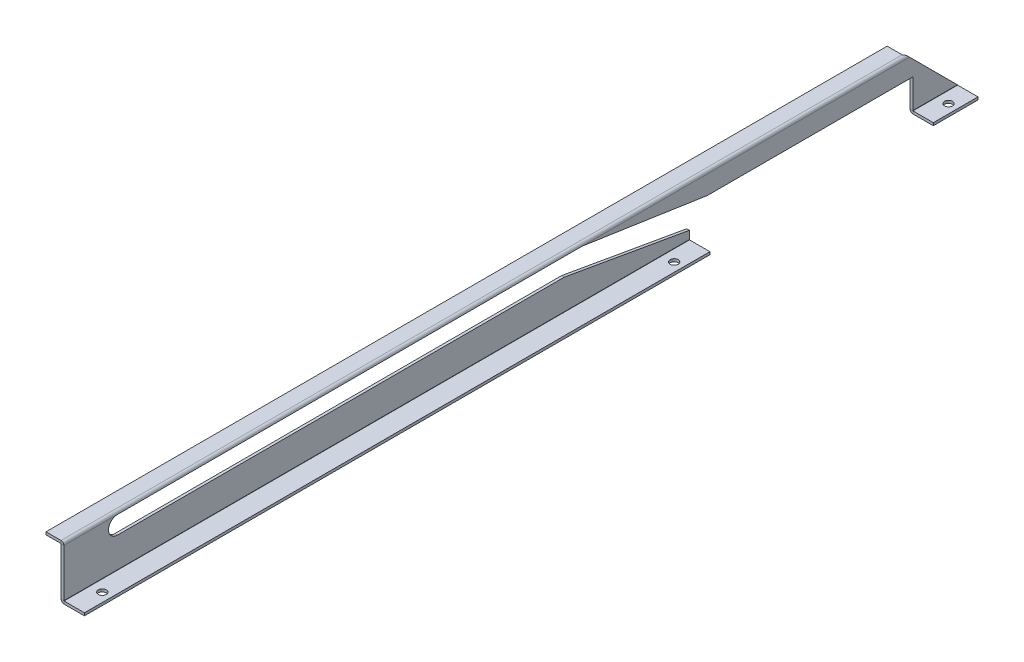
ISO-10303-21;
HEADER;
FILE_DESCRIPTION(('STEP AP214'),'2;1');
FILE_NAME('part.step','',(''),(''),'','','');
FILE_SCHEMA(('AUTOMOTIVE_DESIGN { 1 0 10303 214 1 1 1 1 }'));
ENDSEC;
DATA;
#1=APPLICATION_CONTEXT('core data for automotive mechanical design processes');
#2=APPLICATION_PROTOCOL_DEFINITION('international standard','automotive_design',2000,#1);
#3=PRODUCT_CONTEXT('',#1,'mechanical');
#4=PRODUCT('Part','Part','',(#3));
#5=PRODUCT_RELATED_PRODUCT_CATEGORY('part','',(#4));
#6=PRODUCT_DEFINITION_FORMATION('','',#4);
#7=PRODUCT_DEFINITION_CONTEXT('part definition',#1,'design');
#8=PRODUCT_DEFINITION('design','',#6,#7);
#9=PRODUCT_DEFINITION_SHAPE('','',#8);
#10=(LENGTH_UNIT() NAMED_UNIT(*) SI_UNIT(.MILLI.,.METRE.));
#11=(NAMED_UNIT(*) PLANE_ANGLE_UNIT() SI_UNIT($,.RADIAN.));
#12=(NAMED_UNIT(*) SI_UNIT($,.STERADIAN.) SOLID_ANGLE_UNIT());
#13=UNCERTAINTY_MEASURE_WITH_UNIT(LENGTH_MEASURE(1.E-05),#10,'distance_accuracy_value','');
#14=(GEOMETRIC_REPRESENTATION_CONTEXT(3) GLOBAL_UNCERTAINTY_ASSIGNED_CONTEXT((#13)) GLOBAL_UNIT_ASSIGNED_CONTEXT((#10,
#11,#12)) REPRESENTATION_CONTEXT('',''));
#15=CARTESIAN_POINT('',(0.,0.,0.));
#16=DIRECTION('',(0.,0.,1.));
#17=DIRECTION('',(1.,0.,0.));
#18=AXIS2_PLACEMENT_3D('',#15,#16,#17);
#19=CARTESIAN_POINT('',(-1.50000000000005,28.4999999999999,-500.));
#20=DIRECTION('',(-1.,0.,0.));
#21=DIRECTION('',(0.,-1.,0.));
#22=AXIS2_PLACEMENT_3D('',#19,#20,#21);
#23=PLANE('',#22);
#24=DIRECTION('',(0.,-1.,0.));
#25=VECTOR('',#24,1.);
#26=CARTESIAN_POINT('',(-1.50000000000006,-2.41327412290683,-475.));
#27=LINE('',#26,#25);
#28=CARTESIAN_POINT('',(-1.50000000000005,16.4132741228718,-475.));
#29=VERTEX_POINT('',#28);
#30=CARTESIAN_POINT('',(-1.49999999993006,0.100000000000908,-475.));
#31=VERTEX_POINT('',#30);
#32=EDGE_CURVE('E408',#29,#31,#27,.T.);
#33=ORIENTED_EDGE('',*,*,#32,.F.);
#34=DIRECTION('',(0.,0.,-1.));
#35=VECTOR('',#34,1.);
#36=CARTESIAN_POINT('',(-1.50000000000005,16.4132741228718,-475.));
#37=LINE('',#36,#35);
#38=CARTESIAN_POINT('',(-1.50000000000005,16.4132741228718,-360.));
#39=VERTEX_POINT('',#38);
#40=EDGE_CURVE('E405',#39,#29,#37,.T.);
#41=ORIENTED_EDGE('',*,*,#40,.F.);
#42=DIRECTION('',(0.,-0.148157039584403,-0.988963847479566));
#43=VECTOR('',#42,1.);
#44=CARTESIAN_POINT('',(-1.50000000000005,16.4132741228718,-360.));
#45=LINE('',#44,#43);
#46=CARTESIAN_POINT('',(-1.50000000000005,26.8999999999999,-290.));
#47=VERTEX_POINT('',#46);
#48=EDGE_CURVE('E399',#47,#39,#45,.T.);
#49=ORIENTED_EDGE('',*,*,#48,.F.);
#50=DIRECTION('',(0.,0.,1.));
#51=VECTOR('',#50,1.);
#52=CARTESIAN_POINT('',(-1.50000000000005,26.8999999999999,-500.));
#53=LINE('',#52,#51);
#54=CARTESIAN_POINT('',(-1.49999998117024,26.8999999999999,-473.2));
#55=VERTEX_POINT('',#54);
#56=EDGE_CURVE('E56',#55,#47,#53,.T.);
#57=ORIENTED_EDGE('',*,*,#56,.F.);
#58=DIRECTION('',(0.,0.707106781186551,0.707106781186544));
#59=VECTOR('',#58,1.);
#60=CARTESIAN_POINT('',(-1.50000000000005,14.3000000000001,-485.8));
#61=LINE('',#60,#59);
#62=CARTESIAN_POINT('',(-1.50000000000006,0.100000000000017,-500.));
#63=VERTEX_POINT('',#62);
#64=EDGE_CURVE('E420',#63,#55,#61,.T.);
#65=ORIENTED_EDGE('',*,*,#64,.F.);
#66=DIRECTION('',(0.,0.,1.));
#67=VECTOR('',#66,1.);
#68=CARTESIAN_POINT('',(-1.50000000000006,0.100000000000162,-500.));
#69=LINE('',#68,#67);
#70=EDGE_CURVE('E72',#63,#31,#69,.T.);
#71=ORIENTED_EDGE('',*,*,#70,.T.);
#72=EDGE_LOOP('',(#33,#41,#49,#57,#65,#71));
#73=FACE_BOUND('',#72,.T.);
#74=ADVANCED_FACE('F48',(#73),#23,.T.);
#75=CARTESIAN_POINT('',(0.,28.4999999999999,-500.));
#76=DIRECTION('',(-1.,0.,0.));
#77=DIRECTION('',(0.,-1.,0.));
#78=AXIS2_PLACEMENT_3D('',#75,#76,#77);
#79=PLANE('',#78);
#80=DIRECTION('',(0.,0.,-1.));
#81=VECTOR('',#80,1.);
#82=CARTESIAN_POINT('',(0.,16.4132741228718,-500.));
#83=LINE('',#82,#81);
#84=CARTESIAN_POINT('',(0.,16.4132741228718,-360.));
#85=VERTEX_POINT('',#84);
#86=CARTESIAN_POINT('',(0.,16.4132741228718,-475.));
#87=VERTEX_POINT('',#86);
#88=EDGE_CURVE('E458',#85,#87,#83,.T.);
#89=ORIENTED_EDGE('',*,*,#88,.T.);
#90=DIRECTION('',(0.,-1.,0.));
#91=VECTOR('',#90,1.);
#92=CARTESIAN_POINT('',(0.,28.4999999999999,-475.));
#93=LINE('',#92,#91);
#94=CARTESIAN_POINT('',(3.49435243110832E-11,0.100000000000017,-475.));
#95=VERTEX_POINT('',#94);
#96=EDGE_CURVE('E414',#87,#95,#93,.T.);
#97=ORIENTED_EDGE('',*,*,#96,.T.);
#98=DIRECTION('',(0.,0.,1.));
#99=VECTOR('',#98,1.);
#100=CARTESIAN_POINT('',(0.,0.0999999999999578,-500.));
#101=LINE('',#100,#99);
#102=CARTESIAN_POINT('',(3.49435243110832E-11,0.100000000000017,-500.));
#103=VERTEX_POINT('',#102);
#104=EDGE_CURVE('E466',#103,#95,#101,.T.);
#105=ORIENTED_EDGE('',*,*,#104,.F.);
#106=DIRECTION('',(0.,-0.707106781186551,-0.707106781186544));
#107=VECTOR('',#106,1.);
#108=CARTESIAN_POINT('',(0.,0.100000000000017,-500.));
#109=LINE('',#108,#107);
#110=CARTESIAN_POINT('',(1.88297595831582E-08,26.8999999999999,-473.2));
#111=VERTEX_POINT('',#110);
#112=EDGE_CURVE('E417',#111,#103,#109,.T.);
#113=ORIENTED_EDGE('',*,*,#112,.F.);
#114=DIRECTION('',(0.,0.,1.));
#115=VECTOR('',#114,1.);
#116=CARTESIAN_POINT('',(0.,26.8999999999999,-500.));
#117=LINE('',#116,#115);
#118=CARTESIAN_POINT('',(1.88297597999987E-08,26.8999999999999,-290.));
#119=VERTEX_POINT('',#118);
#120=EDGE_CURVE('E478',#111,#119,#117,.T.);
#121=ORIENTED_EDGE('',*,*,#120,.T.);
#122=DIRECTION('',(0.,-0.148157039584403,-0.988963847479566));
#123=VECTOR('',#122,1.);
#124=CARTESIAN_POINT('',(0.,-3.83448992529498,-495.155958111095));
#125=LINE('',#124,#123);
#126=EDGE_CURVE('E411',#119,#85,#125,.T.);
#127=ORIENTED_EDGE('',*,*,#126,.T.);
#128=EDGE_LOOP('',(#89,#97,#105,#113,#121,#127));
#129=FACE_BOUND('',#128,.T.);
#130=ADVANCED_FACE('F444',(#129),#79,.F.);
#131=CARTESIAN_POINT('',(-1.50005000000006,0.100000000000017,-500.));
#132=DIRECTION('',(0.,-0.707106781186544,0.707106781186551));
#133=DIRECTION('',(0.,-0.707106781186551,-0.707106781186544));
#134=AXIS2_PLACEMENT_3D('',#131,#132,#133);
#135=PLANE('',#134);
#136=CARTESIAN_POINT('',(1.88297595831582E-08,26.8999999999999,-473.2));
#137=CARTESIAN_POINT('',(-1.49999998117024,26.8999999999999,-473.2));
#138=B_SPLINE_CURVE_WITH_KNOTS('',1,(#136,#137),.UNSPECIFIED.,.F.,.F.,(2,2),(0.,1.),.UNSPECIFIED.);
#139=EDGE_CURVE('E427',#55,#111,#138,.F.);
#140=ORIENTED_EDGE('',*,*,#139,.T.);
#141=ORIENTED_EDGE('',*,*,#112,.T.);
#142=DIRECTION('',(-1.,1.36031232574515E-13,0.));
#143=VECTOR('',#142,1.);
#144=CARTESIAN_POINT('',(0.,0.0999999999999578,-500.));
#145=LINE('',#144,#143);
#146=EDGE_CURVE('E475',#103,#63,#145,.T.);
#147=ORIENTED_EDGE('',*,*,#146,.T.);
#148=ORIENTED_EDGE('',*,*,#64,.T.);
#149=EDGE_LOOP('',(#140,#141,#147,#148));
#150=FACE_BOUND('',#149,.T.);
#151=ADVANCED_FACE('F433',(#150),#135,.F.);
#152=CARTESIAN_POINT('',(-1.50000000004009,-2.41327412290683,-475.));
#153=DIRECTION('',(0.,0.,-1.));
#154=DIRECTION('',(1.35830067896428E-13,1.,0.));
#155=AXIS2_PLACEMENT_3D('',#152,#153,#154);
#156=PLANE('',#155);
#157=DIRECTION('',(-1.,5.94142790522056E-13,0.));
#158=VECTOR('',#157,1.);
#159=CARTESIAN_POINT('',(0.,0.100000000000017,-475.));
#160=LINE('',#159,#158);
#161=EDGE_CURVE('E469',#95,#31,#160,.T.);
#162=ORIENTED_EDGE('',*,*,#161,.F.);
#163=ORIENTED_EDGE('',*,*,#96,.F.);
#164=DIRECTION('',(-1.,0.,0.));
#165=VECTOR('',#164,1.);
#166=CARTESIAN_POINT('',(0.00377501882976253,16.4132741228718,-475.));
#167=LINE('',#166,#165);
#168=EDGE_CURVE('E409',#87,#29,#167,.T.);
#169=ORIENTED_EDGE('',*,*,#168,.T.);
#170=ORIENTED_EDGE('',*,*,#32,.T.);
#171=EDGE_LOOP('',(#162,#163,#169,#170));
#172=FACE_BOUND('',#171,.T.);
#173=ADVANCED_FACE('F443',(#172),#156,.F.);
#174=CARTESIAN_POINT('',(0.00377501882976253,16.4132741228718,-475.));
#175=DIRECTION('',(0.,1.,0.));
#176=DIRECTION('',(-1.,0.,0.));
#177=AXIS2_PLACEMENT_3D('',#174,#175,#176);
#178=PLANE('',#177);
#179=DIRECTION('',(-1.,0.,0.));
#180=VECTOR('',#179,1.);
#181=CARTESIAN_POINT('',(0.00377501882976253,16.4132741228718,-360.));
#182=LINE('',#181,#180);
#183=EDGE_CURVE('E412',#85,#39,#182,.T.);
#184=ORIENTED_EDGE('',*,*,#183,.T.);
#185=ORIENTED_EDGE('',*,*,#40,.T.);
#186=ORIENTED_EDGE('',*,*,#168,.F.);
#187=ORIENTED_EDGE('',*,*,#88,.F.);
#188=EDGE_LOOP('',(#184,#185,#186,#187));
#189=FACE_BOUND('',#188,.T.);
#190=ADVANCED_FACE('F448',(#189),#178,.F.);
#191=CARTESIAN_POINT('',(0.00377501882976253,16.4132741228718,-360.));
#192=DIRECTION('',(0.,0.988963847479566,-0.148157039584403));
#193=DIRECTION('',(0.,0.148157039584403,0.988963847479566));
#194=AXIS2_PLACEMENT_3D('',#191,#192,#193);
#195=PLANE('',#194);
#196=DIRECTION('',(-1.,0.,0.));
#197=VECTOR('',#196,1.);
#198=CARTESIAN_POINT('',(0.0037750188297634,26.8999999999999,-290.));
#199=LINE('',#198,#197);
#200=EDGE_CURVE('E12',#119,#47,#199,.T.);
#201=ORIENTED_EDGE('',*,*,#200,.T.);
#202=ORIENTED_EDGE('',*,*,#48,.T.);
#203=ORIENTED_EDGE('',*,*,#183,.F.);
#204=ORIENTED_EDGE('',*,*,#126,.F.);
#205=EDGE_LOOP('',(#201,#202,#203,#204));
#206=FACE_BOUND('',#205,.T.);
#207=ADVANCED_FACE('F445',(#206),#195,.F.);
#208=CARTESIAN_POINT('',(0.0999999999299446,0.0999999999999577,-475.));
#209=DIRECTION('',(0.,0.,-1.));
#210=DIRECTION('',(-1.,0.,0.));
#211=AXIS2_PLACEMENT_3D('',#208,#209,#210);
#212=PLANE('',#211);
#213=ORIENTED_EDGE('',*,*,#161,.T.);
#214=CARTESIAN_POINT('',(0.0999999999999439,0.0999999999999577,-475.));
#215=DIRECTION('',(0.,0.,-1.));
#216=DIRECTION('',(-1.,0.,0.));
#217=AXIS2_PLACEMENT_3D('',#214,#215,#216);
#218=CIRCLE('',#217,1.59999999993);
#219=CARTESIAN_POINT('',(0.0999999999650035,-1.50000000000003,-475.));
#220=VERTEX_POINT('',#219);
#221=EDGE_CURVE('E350',#31,#220,#218,.F.);
#222=ORIENTED_EDGE('',*,*,#221,.T.);
#223=DIRECTION('',(-1.35830067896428E-13,1.,0.));
#224=VECTOR('',#223,1.);
#225=CARTESIAN_POINT('',(0.0999999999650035,-1.50000000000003,-475.));
#226=LINE('',#225,#224);
#227=CARTESIAN_POINT('',(0.0999999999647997,-3.49825842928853E-11,-475.));
#228=VERTEX_POINT('',#227);
#229=EDGE_CURVE('E385',#220,#228,#226,.T.);
#230=ORIENTED_EDGE('',*,*,#229,.T.);
#231=CARTESIAN_POINT('',(0.0999999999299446,0.0999999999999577,-475.));
#232=DIRECTION('',(0.,0.,1.));
#233=DIRECTION('',(-1.,0.,0.));
#234=AXIS2_PLACEMENT_3D('',#231,#232,#233);
#235=CIRCLE('',#234,0.0999999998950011);
#236=EDGE_CURVE('E400',#95,#228,#235,.T.);
#237=ORIENTED_EDGE('',*,*,#236,.F.);
#238=EDGE_LOOP('',(#213,#222,#230,#237));
#239=FACE_BOUND('',#238,.T.);
#240=ADVANCED_FACE('F502',(#239),#212,.F.);
#241=CARTESIAN_POINT('',(0.0999999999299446,0.0999999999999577,-500.));
#242=DIRECTION('',(0.,0.,1.));
#243=DIRECTION('',(1.,0.,0.));
#244=AXIS2_PLACEMENT_3D('',#241,#242,#243);
#245=PLANE('',#244);
#246=DIRECTION('',(0.,1.,0.));
#247=VECTOR('',#246,1.);
#248=CARTESIAN_POINT('',(0.0999999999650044,-1.50000000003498,-500.));
#249=LINE('',#248,#247);
#250=CARTESIAN_POINT('',(0.0999999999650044,-1.50000000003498,-500.));
#251=VERTEX_POINT('',#250);
#252=CARTESIAN_POINT('',(0.100000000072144,6.99570474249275E-11,-500.));
#253=VERTEX_POINT('',#252);
#254=EDGE_CURVE('E353',#251,#253,#249,.T.);
#255=ORIENTED_EDGE('',*,*,#254,.F.);
#256=CARTESIAN_POINT('',(0.0999999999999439,0.0999999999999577,-500.));
#257=DIRECTION('',(0.,0.,-1.));
#258=DIRECTION('',(-1.,0.,0.));
#259=AXIS2_PLACEMENT_3D('',#256,#257,#258);
#260=CIRCLE('',#259,1.59999999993);
#261=EDGE_CURVE('E401',#251,#63,#260,.T.);
#262=ORIENTED_EDGE('',*,*,#261,.T.);
#263=ORIENTED_EDGE('',*,*,#146,.F.);
#264=CARTESIAN_POINT('',(0.0999999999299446,0.0999999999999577,-500.));
#265=DIRECTION('',(0.,0.,-1.));
#266=DIRECTION('',(-1.,0.,0.));
#267=AXIS2_PLACEMENT_3D('',#264,#265,#266);
#268=CIRCLE('',#267,0.0999999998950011);
#269=EDGE_CURVE('E396',#253,#103,#268,.T.);
#270=ORIENTED_EDGE('',*,*,#269,.F.);
#271=EDGE_LOOP('',(#255,#262,#263,#270));
#272=FACE_BOUND('',#271,.T.);
#273=ADVANCED_FACE('F511',(#272),#245,.F.);
#274=CARTESIAN_POINT('',(0.0999999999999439,0.0999999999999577,-462.329252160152));
#275=DIRECTION('',(0.,0.,-1.));
#276=DIRECTION('',(-1.,0.,0.));
#277=AXIS2_PLACEMENT_3D('',#274,#275,#276);
#278=CYLINDRICAL_SURFACE('',#277,0.0999999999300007);
#279=ORIENTED_EDGE('',*,*,#269,.T.);
#280=ORIENTED_EDGE('',*,*,#104,.T.);
#281=ORIENTED_EDGE('',*,*,#236,.T.);
#282=DIRECTION('',(0.,0.,1.));
#283=VECTOR('',#282,1.);
#284=CARTESIAN_POINT('',(0.0999999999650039,-3.49826197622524E-11,-500.));
#285=LINE('',#284,#283);
#286=EDGE_CURVE('E374',#253,#228,#285,.T.);
#287=ORIENTED_EDGE('',*,*,#286,.F.);
#288=EDGE_LOOP('',(#279,#280,#281,#287));
#289=FACE_BOUND('',#288,.T.);
#290=ADVANCED_FACE('F523',(#289),#278,.F.);
#291=CARTESIAN_POINT('',(0.0999999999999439,0.0999999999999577,-462.329252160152));
#292=DIRECTION('',(0.,0.,-1.));
#293=DIRECTION('',(-1.,0.,0.));
#294=AXIS2_PLACEMENT_3D('',#291,#292,#293);
#295=CYLINDRICAL_SURFACE('',#294,1.59999999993);
#296=ORIENTED_EDGE('',*,*,#261,.F.);
#297=DIRECTION('',(0.,0.,1.));
#298=VECTOR('',#297,1.);
#299=CARTESIAN_POINT('',(0.0999999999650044,-1.50000000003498,-500.));
#300=LINE('',#299,#298);
#301=EDGE_CURVE('E388',#251,#220,#300,.T.);
#302=ORIENTED_EDGE('',*,*,#301,.T.);
#303=ORIENTED_EDGE('',*,*,#221,.F.);
#304=ORIENTED_EDGE('',*,*,#70,.F.);
#305=EDGE_LOOP('',(#296,#302,#303,#304));
#306=FACE_BOUND('',#305,.T.);
#307=ADVANCED_FACE('F503',(#306),#295,.T.);
#308=CARTESIAN_POINT('',(11.499999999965,-3.49826197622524E-11,-500.));
#309=DIRECTION('',(-1.,0.,0.));
#310=DIRECTION('',(0.,0.,1.));
#311=AXIS2_PLACEMENT_3D('',#308,#309,#310);
#312=PLANE('',#311);
#313=DIRECTION('',(0.,0.,1.));
#314=VECTOR('',#313,1.);
#315=CARTESIAN_POINT('',(11.499999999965,-3.49826197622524E-11,-500.));
#316=LINE('',#315,#314);
#317=CARTESIAN_POINT('',(11.499999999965,-3.49826197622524E-11,-500.));
#318=VERTEX_POINT('',#317);
#319=CARTESIAN_POINT('',(11.499999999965,-3.49826197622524E-11,-475.));
#320=VERTEX_POINT('',#319);
#321=EDGE_CURVE('E382',#318,#320,#316,.T.);
#322=ORIENTED_EDGE('',*,*,#321,.T.);
#323=DIRECTION('',(0.,1.,0.));
#324=VECTOR('',#323,1.);
#325=CARTESIAN_POINT('',(11.499999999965,-1.50000000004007,-475.));
#326=LINE('',#325,#324);
#327=CARTESIAN_POINT('',(11.499999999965,-1.50000000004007,-475.));
#328=VERTEX_POINT('',#327);
#329=EDGE_CURVE('E370',#328,#320,#326,.T.);
#330=ORIENTED_EDGE('',*,*,#329,.F.);
#331=DIRECTION('',(0.,0.,1.));
#332=VECTOR('',#331,1.);
#333=CARTESIAN_POINT('',(11.499999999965,-1.50000000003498,-500.));
#334=LINE('',#333,#332);
#335=CARTESIAN_POINT('',(11.499999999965,-1.50000000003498,-500.));
#336=VERTEX_POINT('',#335);
#337=EDGE_CURVE('E355',#336,#328,#334,.T.);
#338=ORIENTED_EDGE('',*,*,#337,.F.);
#339=DIRECTION('',(0.,-1.,0.));
#340=VECTOR('',#339,1.);
#341=CARTESIAN_POINT('',(11.499999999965,-3.49826197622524E-11,-500.));
#342=LINE('',#341,#340);
#343=EDGE_CURVE('E348',#318,#336,#342,.T.);
#344=ORIENTED_EDGE('',*,*,#343,.F.);
#345=EDGE_LOOP('',(#322,#330,#338,#344));
#346=FACE_BOUND('',#345,.T.);
#347=ADVANCED_FACE('F637',(#346),#312,.F.);
#348=CARTESIAN_POINT('',(6.49999999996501,-1.50000000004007,-488.5));
#349=DIRECTION('',(0.,1.,0.));
#350=DIRECTION('',(0.,0.,1.));
#351=AXIS2_PLACEMENT_3D('',#348,#349,#350);
#352=CYLINDRICAL_SURFACE('',#351,2.25);
#353=CARTESIAN_POINT('',(6.49999999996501,-1.50000000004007,-488.5));
#354=DIRECTION('',(0.,1.,0.));
#355=DIRECTION('',(0.,0.,1.));
#356=AXIS2_PLACEMENT_3D('',#353,#354,#355);
#357=CIRCLE('',#356,2.25);
#358=CARTESIAN_POINT('',(6.49999999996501,-1.50000000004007,-486.25));
#359=VERTEX_POINT('',#358);
#360=EDGE_CURVE('E363',#359,#359,#357,.T.);
#361=ORIENTED_EDGE('',*,*,#360,.F.);
#362=EDGE_LOOP('',(#361));
#363=FACE_BOUND('',#362,.T.);
#364=CARTESIAN_POINT('',(6.49999999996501,-3.49826197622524E-11,-488.5));
#365=DIRECTION('',(0.,1.,0.));
#366=DIRECTION('',(0.,0.,1.));
#367=AXIS2_PLACEMENT_3D('',#364,#365,#366);
#368=CIRCLE('',#367,2.25);
#369=CARTESIAN_POINT('',(6.49999999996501,-3.49826197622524E-11,-486.25));
#370=VERTEX_POINT('',#369);
#371=EDGE_CURVE('E377',#370,#370,#368,.T.);
#372=ORIENTED_EDGE('',*,*,#371,.T.);
#373=EDGE_LOOP('',(#372));
#374=FACE_BOUND('',#373,.T.);
#375=ADVANCED_FACE('F640',(#363,#374),#352,.F.);
#376=CARTESIAN_POINT('',(-3.49958777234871E-11,-3.49826197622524E-11,-500.));
#377=DIRECTION('',(0.,-1.,0.));
#378=DIRECTION('',(0.,0.,-1.));
#379=AXIS2_PLACEMENT_3D('',#376,#377,#378);
#380=PLANE('',#379);
#381=ORIENTED_EDGE('',*,*,#371,.F.);
#382=EDGE_LOOP('',(#381));
#383=FACE_BOUND('',#382,.T.);
#384=ORIENTED_EDGE('',*,*,#286,.T.);
#385=DIRECTION('',(-1.,0.,0.));
#386=VECTOR('',#385,1.);
#387=CARTESIAN_POINT('',(0.0999999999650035,-3.49826197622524E-11,-475.));
#388=LINE('',#387,#386);
#389=EDGE_CURVE('E368',#320,#228,#388,.T.);
#390=ORIENTED_EDGE('',*,*,#389,.F.);
#391=ORIENTED_EDGE('',*,*,#321,.F.);
#392=DIRECTION('',(1.,0.,0.));
#393=VECTOR('',#392,1.);
#394=CARTESIAN_POINT('',(-3.49958777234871E-11,-3.49826197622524E-11,-500.));
#395=LINE('',#394,#393);
#396=EDGE_CURVE('E351',#253,#318,#395,.T.);
#397=ORIENTED_EDGE('',*,*,#396,.F.);
#398=EDGE_LOOP('',(#384,#390,#391,#397));
#399=FACE_BOUND('',#398,.T.);
#400=ADVANCED_FACE('F519',(#383,#399),#380,.F.);
#401=CARTESIAN_POINT('',(0.0999999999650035,-1.50000000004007,-475.));
#402=DIRECTION('',(0.,0.,-1.));
#403=DIRECTION('',(-1.,0.,0.));
#404=AXIS2_PLACEMENT_3D('',#401,#402,#403);
#405=PLANE('',#404);
#406=ORIENTED_EDGE('',*,*,#229,.F.);
#407=DIRECTION('',(-1.,0.,0.));
#408=VECTOR('',#407,1.);
#409=CARTESIAN_POINT('',(0.0999999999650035,-1.50000000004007,-475.));
#410=LINE('',#409,#408);
#411=EDGE_CURVE('E361',#328,#220,#410,.T.);
#412=ORIENTED_EDGE('',*,*,#411,.F.);
#413=ORIENTED_EDGE('',*,*,#329,.T.);
#414=ORIENTED_EDGE('',*,*,#389,.T.);
#415=EDGE_LOOP('',(#406,#412,#413,#414));
#416=FACE_BOUND('',#415,.T.);
#417=ADVANCED_FACE('F647',(#416),#405,.F.);
#418=CARTESIAN_POINT('',(-3.49958777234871E-11,-1.50000000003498,-500.));
#419=DIRECTION('',(0.,-1.,0.));
#420=DIRECTION('',(0.,0.,-1.));
#421=AXIS2_PLACEMENT_3D('',#418,#419,#420);
#422=PLANE('',#421);
#423=ORIENTED_EDGE('',*,*,#360,.T.);
#424=EDGE_LOOP('',(#423));
#425=FACE_BOUND('',#424,.T.);
#426=ORIENTED_EDGE('',*,*,#411,.T.);
#427=ORIENTED_EDGE('',*,*,#301,.F.);
#428=DIRECTION('',(1.,0.,0.));
#429=VECTOR('',#428,1.);
#430=CARTESIAN_POINT('',(-3.49958777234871E-11,-1.50000000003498,-500.));
#431=LINE('',#430,#429);
#432=EDGE_CURVE('E358',#251,#336,#431,.T.);
#433=ORIENTED_EDGE('',*,*,#432,.T.);
#434=ORIENTED_EDGE('',*,*,#337,.T.);
#435=EDGE_LOOP('',(#426,#427,#433,#434));
#436=FACE_BOUND('',#435,.T.);
#437=ADVANCED_FACE('F507',(#425,#436),#422,.T.);
#438=CARTESIAN_POINT('',(0.0999999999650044,0.0999999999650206,-500.));
#439=DIRECTION('',(0.,0.,-1.));
#440=DIRECTION('',(-1.,0.,0.));
#441=AXIS2_PLACEMENT_3D('',#438,#439,#440);
#442=PLANE('',#441);
#443=ORIENTED_EDGE('',*,*,#432,.F.);
#444=ORIENTED_EDGE('',*,*,#254,.T.);
#445=ORIENTED_EDGE('',*,*,#396,.T.);
#446=ORIENTED_EDGE('',*,*,#343,.T.);
#447=EDGE_LOOP('',(#443,#444,#445,#446));
#448=FACE_BOUND('',#447,.T.);
#449=ADVANCED_FACE('F515',(#448),#442,.T.);
#450=CARTESIAN_POINT('',(1.88297597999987E-08,26.8999999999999,-236.599999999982));
#451=DIRECTION('',(0.,-1.,0.));
#452=DIRECTION('',(0.,0.,-1.));
#453=AXIS2_PLACEMENT_3D('',#450,#451,#452);
#454=PLANE('',#453);
#455=ORIENTED_EDGE('',*,*,#200,.F.);
#456=DIRECTION('',(0.,0.,-1.));
#457=VECTOR('',#456,1.);
#458=CARTESIAN_POINT('',(1.88297597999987E-08,26.8999999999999,-473.2));
#459=LINE('',#458,#457);
#460=CARTESIAN_POINT('',(0.,26.8999999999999,-30.));
#461=VERTEX_POINT('',#460);
#462=EDGE_CURVE('E1095',#461,#119,#459,.T.);
#463=ORIENTED_EDGE('',*,*,#462,.F.);
#464=DIRECTION('',(-1.,0.,0.));
#465=VECTOR('',#464,1.);
#466=CARTESIAN_POINT('',(0.0037750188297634,26.8999999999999,-30.));
#467=LINE('',#466,#465);
#468=CARTESIAN_POINT('',(-1.49999998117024,26.8999999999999,-30.));
#469=VERTEX_POINT('',#468);
#470=EDGE_CURVE('E224',#461,#469,#467,.T.);
#471=ORIENTED_EDGE('',*,*,#470,.T.);
#472=DIRECTION('',(0.,0.,1.));
#473=VECTOR('',#472,1.);
#474=CARTESIAN_POINT('',(-1.49999998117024,26.8999999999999,-236.599999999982));
#475=LINE('',#474,#473);
#476=EDGE_CURVE('E64',#469,#47,#475,.F.);
#477=ORIENTED_EDGE('',*,*,#476,.T.);
#478=EDGE_LOOP('',(#455,#463,#471,#477));
#479=FACE_BOUND('',#478,.T.);
#480=ADVANCED_FACE('F574',(#479),#454,.T.);
#481=CARTESIAN_POINT('',(-9.99999994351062,26.9999999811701,-499.99999999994));
#482=DIRECTION('',(1.,0.,0.));
#483=DIRECTION('',(0.,0.,-1.));
#484=AXIS2_PLACEMENT_3D('',#481,#482,#483);
#485=PLANE('',#484);
#486=DIRECTION('',(0.,0.,1.));
#487=VECTOR('',#486,1.);
#488=CARTESIAN_POINT('',(-9.99999994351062,28.4999999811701,-499.99999999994));
#489=LINE('',#488,#487);
#490=CARTESIAN_POINT('',(-9.99999994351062,28.4999999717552,-470.686725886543));
#491=VERTEX_POINT('',#490);
#492=CARTESIAN_POINT('',(-9.99999994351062,28.4999999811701,6.02295990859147E-11));
#493=VERTEX_POINT('',#492);
#494=EDGE_CURVE('E1110',#491,#493,#489,.T.);
#495=ORIENTED_EDGE('',*,*,#494,.F.);
#496=DIRECTION('',(0.,1.,0.));
#497=VECTOR('',#496,1.);
#498=CARTESIAN_POINT('',(-9.99999994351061,26.9999499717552,-470.686725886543));
#499=LINE('',#498,#497);
#500=CARTESIAN_POINT('',(-9.99999994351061,26.9999999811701,-470.686725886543));
#501=VERTEX_POINT('',#500);
#502=EDGE_CURVE('E1118',#501,#491,#499,.T.);
#503=ORIENTED_EDGE('',*,*,#502,.F.);
#504=DIRECTION('',(0.,0.,1.));
#505=VECTOR('',#504,1.);
#506=CARTESIAN_POINT('',(-9.99999994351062,26.9999999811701,-499.99999999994));
#507=LINE('',#506,#505);
#508=CARTESIAN_POINT('',(-9.99999994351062,26.9999999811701,6.02295990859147E-11));
#509=VERTEX_POINT('',#508);
#510=EDGE_CURVE('E1105',#501,#509,#507,.T.);
#511=ORIENTED_EDGE('',*,*,#510,.T.);
#512=DIRECTION('',(0.,1.,0.));
#513=VECTOR('',#512,1.);
#514=CARTESIAN_POINT('',(-9.99999994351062,26.9999999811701,6.02295990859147E-11));
#515=LINE('',#514,#513);
#516=EDGE_CURVE('E1107',#509,#493,#515,.T.);
#517=ORIENTED_EDGE('',*,*,#516,.T.);
#518=EDGE_LOOP('',(#495,#503,#511,#517));
#519=FACE_BOUND('',#518,.T.);
#520=ADVANCED_FACE('F717',(#519),#485,.F.);
#521=CARTESIAN_POINT('',(-9.99999994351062,28.4999999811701,-499.99999999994));
#522=DIRECTION('',(0.,-1.,0.));
#523=DIRECTION('',(0.,0.,-1.));
#524=AXIS2_PLACEMENT_3D('',#521,#522,#523);
#525=PLANE('',#524);
#526=DIRECTION('',(0.,0.,1.));
#527=VECTOR('',#526,1.);
#528=CARTESIAN_POINT('',(-1.59999994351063,28.4999999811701,-499.99999999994));
#529=LINE('',#528,#527);
#530=CARTESIAN_POINT('',(-1.59999996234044,28.5000000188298,-470.686725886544));
#531=VERTEX_POINT('',#530);
#532=CARTESIAN_POINT('',(-1.59999996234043,28.5000000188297,6.01740879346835E-11));
#533=VERTEX_POINT('',#532);
#534=EDGE_CURVE('E1098',#531,#533,#529,.T.);
#535=ORIENTED_EDGE('',*,*,#534,.F.);
#536=DIRECTION('',(1.,0.,0.));
#537=VECTOR('',#536,1.);
#538=CARTESIAN_POINT('',(-1.59999993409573,28.4999999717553,-470.686725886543));
#539=LINE('',#538,#537);
#540=EDGE_CURVE('E1120',#491,#531,#539,.T.);
#541=ORIENTED_EDGE('',*,*,#540,.F.);
#542=ORIENTED_EDGE('',*,*,#494,.T.);
#543=DIRECTION('',(1.,0.,0.));
#544=VECTOR('',#543,1.);
#545=CARTESIAN_POINT('',(-9.99999994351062,28.4999999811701,6.02295990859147E-11));
#546=LINE('',#545,#544);
#547=EDGE_CURVE('E1112',#493,#533,#546,.T.);
#548=ORIENTED_EDGE('',*,*,#547,.T.);
#549=EDGE_LOOP('',(#535,#541,#542,#548));
#550=FACE_BOUND('',#549,.T.);
#551=ADVANCED_FACE('F630',(#550),#525,.F.);
#552=CARTESIAN_POINT('',(-1.59999993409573,26.9999499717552,-470.686725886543));
#553=DIRECTION('',(0.,0.,1.));
#554=DIRECTION('',(1.,0.,0.));
#555=AXIS2_PLACEMENT_3D('',#552,#553,#554);
#556=PLANE('',#555);
#557=DIRECTION('',(-1.,0.,0.));
#558=VECTOR('',#557,1.);
#559=CARTESIAN_POINT('',(-9.99999994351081,26.9999999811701,-470.686725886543));
#560=LINE('',#559,#558);
#561=CARTESIAN_POINT('',(-1.59999994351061,26.9999999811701,-470.686725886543));
#562=VERTEX_POINT('',#561);
#563=EDGE_CURVE('E1114',#562,#501,#560,.T.);
#564=ORIENTED_EDGE('',*,*,#563,.T.);
#565=ORIENTED_EDGE('',*,*,#502,.T.);
#566=ORIENTED_EDGE('',*,*,#540,.T.);
#567=CARTESIAN_POINT('',(-1.59999999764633,27.0000000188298,-470.686725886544));
#568=CARTESIAN_POINT('',(-1.59999996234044,28.5000000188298,-470.686725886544));
#569=B_SPLINE_CURVE_WITH_KNOTS('',1,(#567,#568),.UNSPECIFIED.,.F.,.F.,(2,2),(0.,1.),.UNSPECIFIED.);
#570=EDGE_CURVE('E613',#562,#531,#569,.T.);
#571=ORIENTED_EDGE('',*,*,#570,.F.);
#572=EDGE_LOOP('',(#564,#565,#566,#571));
#573=FACE_BOUND('',#572,.T.);
#574=ADVANCED_FACE('F619',(#573),#556,.F.);
#575=CARTESIAN_POINT('',(-9.99999994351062,26.9999999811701,-499.99999999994));
#576=DIRECTION('',(0.,-1.,0.));
#577=DIRECTION('',(0.,0.,-1.));
#578=AXIS2_PLACEMENT_3D('',#575,#576,#577);
#579=PLANE('',#578);
#580=ORIENTED_EDGE('',*,*,#563,.F.);
#581=DIRECTION('',(0.,0.,1.));
#582=VECTOR('',#581,1.);
#583=CARTESIAN_POINT('',(-1.59999994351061,26.9999999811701,-499.99999999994));
#584=LINE('',#583,#582);
#585=CARTESIAN_POINT('',(-1.59999994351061,26.9999999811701,6.02295990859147E-11));
#586=VERTEX_POINT('',#585);
#587=EDGE_CURVE('E535',#562,#586,#584,.T.);
#588=ORIENTED_EDGE('',*,*,#587,.T.);
#589=DIRECTION('',(1.,0.,0.));
#590=VECTOR('',#589,1.);
#591=CARTESIAN_POINT('',(-9.99999994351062,26.9999999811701,6.02295990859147E-11));
#592=LINE('',#591,#590);
#593=EDGE_CURVE('E1126',#509,#586,#592,.T.);
#594=ORIENTED_EDGE('',*,*,#593,.F.);
#595=ORIENTED_EDGE('',*,*,#510,.F.);
#596=EDGE_LOOP('',(#580,#588,#594,#595));
#597=FACE_BOUND('',#596,.T.);
#598=ADVANCED_FACE('F629',(#597),#579,.T.);
#599=CARTESIAN_POINT('',(0.100000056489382,0.0999999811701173,6.02295990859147E-11));
#600=DIRECTION('',(0.,0.,-1.));
#601=DIRECTION('',(-1.,0.,0.));
#602=AXIS2_PLACEMENT_3D('',#599,#600,#601);
#603=PLANE('',#602);
#604=ORIENTED_EDGE('',*,*,#593,.T.);
#605=DIRECTION('',(0.,1.,0.));
#606=VECTOR('',#605,1.);
#607=CARTESIAN_POINT('',(-1.59999994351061,26.9999999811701,6.02295990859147E-11));
#608=LINE('',#607,#606);
#609=EDGE_CURVE('E393',#586,#533,#608,.T.);
#610=ORIENTED_EDGE('',*,*,#609,.T.);
#611=ORIENTED_EDGE('',*,*,#547,.F.);
#612=ORIENTED_EDGE('',*,*,#516,.F.);
#613=EDGE_LOOP('',(#604,#610,#611,#612));
#614=FACE_BOUND('',#613,.T.);
#615=ADVANCED_FACE('F573',(#614),#603,.F.);
#616=CARTESIAN_POINT('',(1.88297595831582E-08,26.8999999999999,-473.2));
#617=CARTESIAN_POINT('',(1.88297595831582E-08,27.1094583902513,-472.99054160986));
#618=CARTESIAN_POINT('',(-0.0416436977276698,27.318796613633,-472.781120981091));
#619=CARTESIAN_POINT('',(-0.201941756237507,27.7057903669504,-472.362241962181));
#620=CARTESIAN_POINT('',(-0.320533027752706,27.8832747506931,-472.152802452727));
#621=CARTESIAN_POINT('',(-0.616725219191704,28.1794669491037,-471.733923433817));
#622=CARTESIAN_POINT('',(-0.794209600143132,28.2980582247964,-471.524483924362));
#623=CARTESIAN_POINT('',(-1.18120334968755,28.458356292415,-471.105604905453));
#624=CARTESIAN_POINT('',(-1.39054157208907,28.5000000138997,-470.896184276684));
#625=CARTESIAN_POINT('',(-1.59999996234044,28.5000000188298,-470.686725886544));
#626=CARTESIAN_POINT('',(-1.49999998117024,26.8999999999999,-473.2));
#627=CARTESIAN_POINT('',(-1.49999998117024,26.9130899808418,-472.990560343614));
#628=CARTESIAN_POINT('',(-1.50260271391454,26.9261747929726,-472.781120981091));
#629=CARTESIAN_POINT('',(-1.51262134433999,26.9503619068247,-472.362241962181));
#630=CARTESIAN_POINT('',(-1.52003330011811,26.9614546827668,-472.152802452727));
#631=CARTESIAN_POINT('',(-1.53854531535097,26.9799666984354,-471.733923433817));
#632=CARTESIAN_POINT('',(-1.54963809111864,26.9873786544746,-471.524483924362));
#633=CARTESIAN_POINT('',(-1.5738252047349,26.9973972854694,-471.105604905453));
#634=CARTESIAN_POINT('',(-1.58691001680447,27.0000000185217,-470.89616554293));
#635=CARTESIAN_POINT('',(-1.59999999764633,27.0000000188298,-470.686725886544));
#636=B_SPLINE_SURFACE_WITH_KNOTS('',1,3,((#616,#617,#618,#619,#620,#621,#622,#623,#624,#625),
(#626,#627,#628,#629,#630,#631,#632,#633,#634,#635)),.UNSPECIFIED.,.F.,.F.,.F.,(2,2),(4,2,2,2,
4),(0.,1.),(0.,0.25,0.5,0.75,1.),.UNSPECIFIED.);
#637=CARTESIAN_POINT('',(-1.49999998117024,26.8999999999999,-473.2));
#638=CARTESIAN_POINT('',(-1.49999998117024,26.9130899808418,-472.990560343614));
#639=CARTESIAN_POINT('',(-1.50260271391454,26.9261747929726,-472.781120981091));
#640=CARTESIAN_POINT('',(-1.51262134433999,26.9503619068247,-472.362241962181));
#641=CARTESIAN_POINT('',(-1.52003330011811,26.9614546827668,-472.152802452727));
#642=CARTESIAN_POINT('',(-1.53854531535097,26.9799666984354,-471.733923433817));
#643=CARTESIAN_POINT('',(-1.54963809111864,26.9873786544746,-471.524483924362));
#644=CARTESIAN_POINT('',(-1.5738252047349,26.9973972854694,-471.105604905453));
#645=CARTESIAN_POINT('',(-1.58691001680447,27.0000000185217,-470.89616554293));
#646=CARTESIAN_POINT('',(-1.59999999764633,27.0000000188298,-470.686725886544));
#647=B_SPLINE_CURVE_WITH_KNOTS('',3,(#637,#638,#639,#640,#641,#642,#643,#644,#645,#646),
.UNSPECIFIED.,.F.,.F.,(4,2,2,2,4),(0.,0.25,0.5,0.75,1.),.UNSPECIFIED.);
#648=EDGE_CURVE('E532',#55,#562,#647,.T.);
#649=CARTESIAN_POINT('',(-1.59999996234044,28.5000000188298,-470.686725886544));
#650=CARTESIAN_POINT('',(-1.39054157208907,28.5000000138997,-470.896184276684));
#651=CARTESIAN_POINT('',(-1.18120334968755,28.458356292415,-471.105604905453));
#652=CARTESIAN_POINT('',(-0.794209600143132,28.2980582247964,-471.524483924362));
#653=CARTESIAN_POINT('',(-0.616725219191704,28.1794669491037,-471.733923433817));
#654=CARTESIAN_POINT('',(-0.320533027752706,27.8832747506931,-472.152802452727));
#655=CARTESIAN_POINT('',(-0.201941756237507,27.7057903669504,-472.362241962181));
#656=CARTESIAN_POINT('',(-0.0416436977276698,27.318796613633,-472.781120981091));
#657=CARTESIAN_POINT('',(1.88297595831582E-08,27.1094583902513,-472.99054160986));
#658=CARTESIAN_POINT('',(1.88297595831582E-08,26.8999999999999,-473.2));
#659=B_SPLINE_CURVE_WITH_KNOTS('',3,(#649,#650,#651,#652,#653,#654,#655,#656,#657,#658),
.UNSPECIFIED.,.F.,.F.,(4,2,2,2,4),(0.,0.25,0.5,0.75,1.),.UNSPECIFIED.);
#660=EDGE_CURVE('E1100',#111,#531,#659,.F.);
#661=ORIENTED_EDGE('',*,*,#139,.F.);
#662=ORIENTED_EDGE('',*,*,#648,.T.);
#663=ORIENTED_EDGE('',*,*,#570,.T.);
#664=ORIENTED_EDGE('',*,*,#660,.F.);
#665=EDGE_LOOP('',(#661,#662,#663,#664));
#666=FACE_BOUND('',#665,.T.);
#667=ADVANCED_FACE('F566',(#666),#636,.T.);
#668=CARTESIAN_POINT('',(-1.60000001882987,26.8999999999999,6.01740879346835E-11));
#669=DIRECTION('',(1.50812282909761E-11,0.,1.));
#670=DIRECTION('',(1.,0.,-1.50812282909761E-11));
#671=AXIS2_PLACEMENT_3D('',#668,#669,#670);
#672=PLANE('',#671);
#673=ORIENTED_EDGE('',*,*,#609,.F.);
#674=CARTESIAN_POINT('',(-1.60000001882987,26.8999999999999,6.01740879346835E-11));
#675=DIRECTION('',(-1.50812282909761E-11,0.,-1.));
#676=DIRECTION('',(-1.,0.,1.50812282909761E-11));
#677=AXIS2_PLACEMENT_3D('',#674,#675,#676);
#678=CIRCLE('',#677,0.100000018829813);
#679=CARTESIAN_POINT('',(-1.50000000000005,26.8999999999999,0.));
#680=VERTEX_POINT('',#679);
#681=EDGE_CURVE('E539',#586,#680,#678,.T.);
#682=ORIENTED_EDGE('',*,*,#681,.T.);
#683=DIRECTION('',(-1.,0.,0.));
#684=VECTOR('',#683,1.);
#685=CARTESIAN_POINT('',(0.,26.8999999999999,0.));
#686=LINE('',#685,#684);
#687=CARTESIAN_POINT('',(0.,26.8999999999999,2.18713935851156E-11));
#688=VERTEX_POINT('',#687);
#689=EDGE_CURVE('E1141',#688,#680,#686,.T.);
#690=ORIENTED_EDGE('',*,*,#689,.F.);
#691=CARTESIAN_POINT('',(-1.60000001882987,26.8999999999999,6.01740879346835E-11));
#692=DIRECTION('',(-1.50812282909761E-11,0.,-1.));
#693=DIRECTION('',(-1.,0.,1.50812282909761E-11));
#694=AXIS2_PLACEMENT_3D('',#691,#692,#693);
#695=CIRCLE('',#694,1.60000002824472);
#696=EDGE_CURVE('E336',#533,#688,#695,.T.);
#697=ORIENTED_EDGE('',*,*,#696,.F.);
#698=EDGE_LOOP('',(#673,#682,#690,#697));
#699=FACE_BOUND('',#698,.T.);
#700=ADVANCED_FACE('F563',(#699),#672,.T.);
#701=CARTESIAN_POINT('',(-1.60000000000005,26.8999999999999,-709.809051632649));
#702=DIRECTION('',(0.,0.,1.));
#703=DIRECTION('',(1.,0.,0.));
#704=AXIS2_PLACEMENT_3D('',#701,#702,#703);
#705=CYLINDRICAL_SURFACE('',#704,1.60000001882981);
#706=ORIENTED_EDGE('',*,*,#696,.T.);
#707=DIRECTION('',(0.,0.,1.));
#708=VECTOR('',#707,1.);
#709=CARTESIAN_POINT('',(0.,26.8999999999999,-500.));
#710=LINE('',#709,#708);
#711=EDGE_CURVE('E228',#461,#688,#710,.T.);
#712=ORIENTED_EDGE('',*,*,#711,.F.);
#713=ORIENTED_EDGE('',*,*,#462,.T.);
#714=ORIENTED_EDGE('',*,*,#120,.F.);
#715=ORIENTED_EDGE('',*,*,#660,.T.);
#716=ORIENTED_EDGE('',*,*,#534,.T.);
#717=EDGE_LOOP('',(#706,#712,#713,#714,#715,#716));
#718=FACE_BOUND('',#717,.T.);
#719=ADVANCED_FACE('F560',(#718),#705,.T.);
#720=CARTESIAN_POINT('',(-1.60000000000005,26.8999999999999,-709.809051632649));
#721=DIRECTION('',(0.,0.,1.));
#722=DIRECTION('',(1.,0.,0.));
#723=AXIS2_PLACEMENT_3D('',#720,#721,#722);
#724=CYLINDRICAL_SURFACE('',#723,0.100000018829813);
#725=ORIENTED_EDGE('',*,*,#681,.F.);
#726=ORIENTED_EDGE('',*,*,#587,.F.);
#727=ORIENTED_EDGE('',*,*,#648,.F.);
#728=ORIENTED_EDGE('',*,*,#56,.T.);
#729=ORIENTED_EDGE('',*,*,#476,.F.);
#730=DIRECTION('',(0.,0.,1.));
#731=VECTOR('',#730,1.);
#732=CARTESIAN_POINT('',(-1.50000000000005,26.8999999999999,-500.));
#733=LINE('',#732,#731);
#734=EDGE_CURVE('E331',#469,#680,#733,.T.);
#735=ORIENTED_EDGE('',*,*,#734,.T.);
#736=EDGE_LOOP('',(#725,#726,#727,#728,#729,#735));
#737=FACE_BOUND('',#736,.T.);
#738=ADVANCED_FACE('F528',(#737),#724,.F.);
#739=CARTESIAN_POINT('',(0.0999999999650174,-1.50000000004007,-350.));
#740=DIRECTION('',(0.,0.,1.));
#741=DIRECTION('',(1.,0.,0.));
#742=AXIS2_PLACEMENT_3D('',#739,#740,#741);
#743=PLANE('',#742);
#744=DIRECTION('',(1.35830067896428E-13,-1.,0.));
#745=VECTOR('',#744,1.);
#746=CARTESIAN_POINT('',(0.0999999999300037,-3.498258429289E-11,-350.));
#747=LINE('',#746,#745);
#748=CARTESIAN_POINT('',(0.0999999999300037,-3.498258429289E-11,-350.));
#749=VERTEX_POINT('',#748);
#750=CARTESIAN_POINT('',(0.0999999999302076,-1.50000000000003,-350.));
#751=VERTEX_POINT('',#750);
#752=EDGE_CURVE('E291',#749,#751,#747,.T.);
#753=ORIENTED_EDGE('',*,*,#752,.F.);
#754=DIRECTION('',(1.,0.,0.));
#755=VECTOR('',#754,1.);
#756=CARTESIAN_POINT('',(0.0999999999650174,-3.49826197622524E-11,-350.));
#757=LINE('',#756,#755);
#758=CARTESIAN_POINT('',(11.499999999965,-3.49826197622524E-11,-350.));
#759=VERTEX_POINT('',#758);
#760=EDGE_CURVE('E329',#749,#759,#757,.T.);
#761=ORIENTED_EDGE('',*,*,#760,.T.);
#762=DIRECTION('',(0.,1.,0.));
#763=VECTOR('',#762,1.);
#764=CARTESIAN_POINT('',(11.499999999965,-1.50000000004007,-350.));
#765=LINE('',#764,#763);
#766=CARTESIAN_POINT('',(11.499999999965,-1.50000000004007,-350.));
#767=VERTEX_POINT('',#766);
#768=EDGE_CURVE('E326',#767,#759,#765,.T.);
#769=ORIENTED_EDGE('',*,*,#768,.F.);
#770=DIRECTION('',(1.,0.,0.));
#771=VECTOR('',#770,1.);
#772=CARTESIAN_POINT('',(0.0999999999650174,-1.50000000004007,-350.));
#773=LINE('',#772,#771);
#774=EDGE_CURVE('E304',#751,#767,#773,.T.);
#775=ORIENTED_EDGE('',*,*,#774,.F.);
#776=EDGE_LOOP('',(#753,#761,#769,#775));
#777=FACE_BOUND('',#776,.T.);
#778=ADVANCED_FACE('F559',(#777),#743,.F.);
#779=CARTESIAN_POINT('',(11.499999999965,-3.49826197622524E-11,-500.));
#780=DIRECTION('',(-1.,0.,0.));
#781=DIRECTION('',(0.,0.,1.));
#782=AXIS2_PLACEMENT_3D('',#779,#780,#781);
#783=PLANE('',#782);
#784=DIRECTION('',(0.,0.,1.));
#785=VECTOR('',#784,1.);
#786=CARTESIAN_POINT('',(11.499999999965,-1.50000000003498,-500.));
#787=LINE('',#786,#785);
#788=CARTESIAN_POINT('',(11.499999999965,-1.50000000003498,0.));
#789=VERTEX_POINT('',#788);
#790=EDGE_CURVE('E302',#767,#789,#787,.T.);
#791=ORIENTED_EDGE('',*,*,#790,.F.);
#792=ORIENTED_EDGE('',*,*,#768,.T.);
#793=DIRECTION('',(0.,0.,1.));
#794=VECTOR('',#793,1.);
#795=CARTESIAN_POINT('',(11.499999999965,-3.49826197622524E-11,-500.));
#796=LINE('',#795,#794);
#797=CARTESIAN_POINT('',(11.499999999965,-3.49826197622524E-11,0.));
#798=VERTEX_POINT('',#797);
#799=EDGE_CURVE('E324',#759,#798,#796,.T.);
#800=ORIENTED_EDGE('',*,*,#799,.T.);
#801=DIRECTION('',(0.,-1.,0.));
#802=VECTOR('',#801,1.);
#803=CARTESIAN_POINT('',(11.499999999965,-3.49826197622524E-11,0.));
#804=LINE('',#803,#802);
#805=EDGE_CURVE('E321',#798,#789,#804,.T.);
#806=ORIENTED_EDGE('',*,*,#805,.T.);
#807=EDGE_LOOP('',(#791,#792,#800,#806));
#808=FACE_BOUND('',#807,.T.);
#809=ADVANCED_FACE('F765',(#808),#783,.F.);
#810=CARTESIAN_POINT('',(6.49999999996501,-1.50000000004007,-15.));
#811=DIRECTION('',(0.,1.,0.));
#812=DIRECTION('',(0.,0.,1.));
#813=AXIS2_PLACEMENT_3D('',#810,#811,#812);
#814=CYLINDRICAL_SURFACE('',#813,2.25);
#815=CARTESIAN_POINT('',(6.49999999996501,-1.50000000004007,-15.));
#816=DIRECTION('',(0.,1.,0.));
#817=DIRECTION('',(0.,0.,1.));
#818=AXIS2_PLACEMENT_3D('',#815,#816,#817);
#819=CIRCLE('',#818,2.25);
#820=CARTESIAN_POINT('',(6.49999999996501,-1.50000000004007,-12.75));
#821=VERTEX_POINT('',#820);
#822=EDGE_CURVE('E307',#821,#821,#819,.T.);
#823=ORIENTED_EDGE('',*,*,#822,.F.);
#824=EDGE_LOOP('',(#823));
#825=FACE_BOUND('',#824,.T.);
#826=CARTESIAN_POINT('',(6.49999999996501,-3.49826197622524E-11,-15.));
#827=DIRECTION('',(0.,1.,0.));
#828=DIRECTION('',(0.,0.,1.));
#829=AXIS2_PLACEMENT_3D('',#826,#827,#828);
#830=CIRCLE('',#829,2.25);
#831=CARTESIAN_POINT('',(6.49999999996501,-3.49826197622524E-11,-12.75));
#832=VERTEX_POINT('',#831);
#833=EDGE_CURVE('E318',#832,#832,#830,.T.);
#834=ORIENTED_EDGE('',*,*,#833,.T.);
#835=EDGE_LOOP('',(#834));
#836=FACE_BOUND('',#835,.T.);
#837=ADVANCED_FACE('F773',(#825,#836),#814,.F.);
#838=CARTESIAN_POINT('',(6.49999999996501,-1.50000000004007,-335.));
#839=DIRECTION('',(0.,1.,0.));
#840=DIRECTION('',(0.,0.,1.));
#841=AXIS2_PLACEMENT_3D('',#838,#839,#840);
#842=CYLINDRICAL_SURFACE('',#841,2.25);
#843=CARTESIAN_POINT('',(6.49999999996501,-1.50000000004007,-335.));
#844=DIRECTION('',(0.,1.,0.));
#845=DIRECTION('',(0.,0.,1.));
#846=AXIS2_PLACEMENT_3D('',#843,#844,#845);
#847=CIRCLE('',#846,2.25);
#848=CARTESIAN_POINT('',(6.49999999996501,-1.50000000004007,-332.75));
#849=VERTEX_POINT('',#848);
#850=EDGE_CURVE('E312',#849,#849,#847,.T.);
#851=ORIENTED_EDGE('',*,*,#850,.F.);
#852=EDGE_LOOP('',(#851));
#853=FACE_BOUND('',#852,.T.);
#854=CARTESIAN_POINT('',(6.49999999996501,-3.49826197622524E-11,-335.));
#855=DIRECTION('',(0.,1.,0.));
#856=DIRECTION('',(0.,0.,1.));
#857=AXIS2_PLACEMENT_3D('',#854,#855,#856);
#858=CIRCLE('',#857,2.25);
#859=CARTESIAN_POINT('',(6.49999999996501,-3.49826197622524E-11,-332.75));
#860=VERTEX_POINT('',#859);
#861=EDGE_CURVE('E315',#860,#860,#858,.T.);
#862=ORIENTED_EDGE('',*,*,#861,.T.);
#863=EDGE_LOOP('',(#862));
#864=FACE_BOUND('',#863,.T.);
#865=ADVANCED_FACE('F781',(#853,#864),#842,.F.);
#866=CARTESIAN_POINT('',(-3.49958777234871E-11,-1.50000000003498,-500.));
#867=DIRECTION('',(0.,-1.,0.));
#868=DIRECTION('',(0.,0.,-1.));
#869=AXIS2_PLACEMENT_3D('',#866,#867,#868);
#870=PLANE('',#869);
#871=ORIENTED_EDGE('',*,*,#850,.T.);
#872=EDGE_LOOP('',(#871));
#873=FACE_BOUND('',#872,.T.);
#874=ORIENTED_EDGE('',*,*,#822,.T.);
#875=EDGE_LOOP('',(#874));
#876=FACE_BOUND('',#875,.T.);
#877=ORIENTED_EDGE('',*,*,#774,.T.);
#878=ORIENTED_EDGE('',*,*,#790,.T.);
#879=DIRECTION('',(1.,0.,0.));
#880=VECTOR('',#879,1.);
#881=CARTESIAN_POINT('',(-3.49958777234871E-11,-1.50000000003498,0.));
#882=LINE('',#881,#880);
#883=CARTESIAN_POINT('',(0.0999999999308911,-1.50000000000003,0.));
#884=VERTEX_POINT('',#883);
#885=EDGE_CURVE('E294',#884,#789,#882,.T.);
#886=ORIENTED_EDGE('',*,*,#885,.F.);
#887=DIRECTION('',(0.,0.,1.));
#888=VECTOR('',#887,1.);
#889=CARTESIAN_POINT('',(0.0999999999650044,-1.50000000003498,-500.));
#890=LINE('',#889,#888);
#891=EDGE_CURVE('E272',#751,#884,#890,.T.);
#892=ORIENTED_EDGE('',*,*,#891,.F.);
#893=EDGE_LOOP('',(#877,#878,#886,#892));
#894=FACE_BOUND('',#893,.T.);
#895=ADVANCED_FACE('F789',(#873,#876,#894),#870,.T.);
#896=CARTESIAN_POINT('',(-1.500000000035,0.0999999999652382,0.));
#897=DIRECTION('',(0.,0.,1.));
#898=DIRECTION('',(1.,0.,0.));
#899=AXIS2_PLACEMENT_3D('',#896,#897,#898);
#900=PLANE('',#899);
#901=DIRECTION('',(1.,0.,0.));
#902=VECTOR('',#901,1.);
#903=CARTESIAN_POINT('',(-3.49958777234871E-11,-3.49826197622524E-11,0.));
#904=LINE('',#903,#902);
#905=CARTESIAN_POINT('',(0.100000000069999,1.04956692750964E-10,0.));
#906=VERTEX_POINT('',#905);
#907=EDGE_CURVE('E275',#906,#798,#904,.T.);
#908=ORIENTED_EDGE('',*,*,#907,.F.);
#909=DIRECTION('',(0.,-1.,0.));
#910=VECTOR('',#909,1.);
#911=CARTESIAN_POINT('',(0.0999999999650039,-3.49826197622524E-11,0.));
#912=LINE('',#911,#910);
#913=EDGE_CURVE('E299',#906,#884,#912,.T.);
#914=ORIENTED_EDGE('',*,*,#913,.T.);
#915=ORIENTED_EDGE('',*,*,#885,.T.);
#916=ORIENTED_EDGE('',*,*,#805,.F.);
#917=EDGE_LOOP('',(#908,#914,#915,#916));
#918=FACE_BOUND('',#917,.T.);
#919=ADVANCED_FACE('F797',(#918),#900,.T.);
#920=CARTESIAN_POINT('',(0.0999999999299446,0.0999999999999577,-350.));
#921=DIRECTION('',(0.,0.,1.));
#922=DIRECTION('',(1.,0.,0.));
#923=AXIS2_PLACEMENT_3D('',#920,#921,#922);
#924=PLANE('',#923);
#925=ORIENTED_EDGE('',*,*,#752,.T.);
#926=CARTESIAN_POINT('',(0.0999999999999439,0.0999999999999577,-350.));
#927=DIRECTION('',(0.,0.,-1.));
#928=DIRECTION('',(-1.,0.,0.));
#929=AXIS2_PLACEMENT_3D('',#926,#927,#928);
#930=CIRCLE('',#929,1.59999999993);
#931=CARTESIAN_POINT('',(-1.50000000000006,0.100000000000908,-350.));
#932=VERTEX_POINT('',#931);
#933=EDGE_CURVE('E288',#751,#932,#930,.T.);
#934=ORIENTED_EDGE('',*,*,#933,.T.);
#935=DIRECTION('',(1.,-5.94142790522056E-13,0.));
#936=VECTOR('',#935,1.);
#937=CARTESIAN_POINT('',(-1.50000000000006,0.100000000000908,-350.));
#938=LINE('',#937,#936);
#939=CARTESIAN_POINT('',(3.49435243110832E-11,0.100000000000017,-350.));
#940=VERTEX_POINT('',#939);
#941=EDGE_CURVE('E283',#932,#940,#938,.T.);
#942=ORIENTED_EDGE('',*,*,#941,.T.);
#943=CARTESIAN_POINT('',(0.0999999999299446,0.0999999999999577,-350.));
#944=DIRECTION('',(0.,0.,-1.));
#945=DIRECTION('',(1.,0.,0.));
#946=AXIS2_PLACEMENT_3D('',#943,#944,#945);
#947=CIRCLE('',#946,0.0999999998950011);
#948=EDGE_CURVE('E255',#749,#940,#947,.T.);
#949=ORIENTED_EDGE('',*,*,#948,.F.);
#950=EDGE_LOOP('',(#925,#934,#942,#949));
#951=FACE_BOUND('',#950,.T.);
#952=ADVANCED_FACE('F805',(#951),#924,.F.);
#953=CARTESIAN_POINT('',(-3.49958777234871E-11,-3.49826197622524E-11,-500.));
#954=DIRECTION('',(0.,-1.,0.));
#955=DIRECTION('',(0.,0.,-1.));
#956=AXIS2_PLACEMENT_3D('',#953,#954,#955);
#957=PLANE('',#956);
#958=ORIENTED_EDGE('',*,*,#861,.F.);
#959=EDGE_LOOP('',(#958));
#960=FACE_BOUND('',#959,.T.);
#961=ORIENTED_EDGE('',*,*,#833,.F.);
#962=EDGE_LOOP('',(#961));
#963=FACE_BOUND('',#962,.T.);
#964=ORIENTED_EDGE('',*,*,#799,.F.);
#965=ORIENTED_EDGE('',*,*,#760,.F.);
#966=DIRECTION('',(0.,0.,1.));
#967=VECTOR('',#966,1.);
#968=CARTESIAN_POINT('',(0.0999999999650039,-3.49826197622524E-11,-500.));
#969=LINE('',#968,#967);
#970=EDGE_CURVE('E280',#749,#906,#969,.T.);
#971=ORIENTED_EDGE('',*,*,#970,.T.);
#972=ORIENTED_EDGE('',*,*,#907,.T.);
#973=EDGE_LOOP('',(#964,#965,#971,#972));
#974=FACE_BOUND('',#973,.T.);
#975=ADVANCED_FACE('F813',(#960,#963,#974),#957,.F.);
#976=CARTESIAN_POINT('',(0.0999999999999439,0.0999999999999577,175.012237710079));
#977=DIRECTION('',(0.,0.,-1.));
#978=DIRECTION('',(-1.,0.,0.));
#979=AXIS2_PLACEMENT_3D('',#976,#977,#978);
#980=CYLINDRICAL_SURFACE('',#979,1.59999999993);
#981=CARTESIAN_POINT('',(0.0999999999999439,0.0999999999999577,1.11022302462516E-13));
#982=DIRECTION('',(0.,0.,-1.));
#983=DIRECTION('',(-1.,0.,0.));
#984=AXIS2_PLACEMENT_3D('',#981,#982,#983);
#985=CIRCLE('',#984,1.59999999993);
#986=CARTESIAN_POINT('',(-1.50000000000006,0.100000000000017,0.));
#987=VERTEX_POINT('',#986);
#988=EDGE_CURVE('E269',#987,#884,#985,.F.);
#989=ORIENTED_EDGE('',*,*,#988,.F.);
#990=DIRECTION('',(0.,0.,1.));
#991=VECTOR('',#990,1.);
#992=CARTESIAN_POINT('',(-1.50000000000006,0.100000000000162,-500.));
#993=LINE('',#992,#991);
#994=EDGE_CURVE('E238',#932,#987,#993,.T.);
#995=ORIENTED_EDGE('',*,*,#994,.F.);
#996=ORIENTED_EDGE('',*,*,#933,.F.);
#997=ORIENTED_EDGE('',*,*,#891,.T.);
#998=EDGE_LOOP('',(#989,#995,#996,#997));
#999=FACE_BOUND('',#998,.T.);
#1000=ADVANCED_FACE('F821',(#999),#980,.T.);
#1001=CARTESIAN_POINT('',(0.0999999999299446,0.0999999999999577,0.));
#1002=DIRECTION('',(0.,0.,-1.));
#1003=DIRECTION('',(-1.,0.,0.));
#1004=AXIS2_PLACEMENT_3D('',#1001,#1002,#1003);
#1005=PLANE('',#1004);
#1006=DIRECTION('',(1.,-1.36031232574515E-13,0.));
#1007=VECTOR('',#1006,1.);
#1008=CARTESIAN_POINT('',(-1.50000000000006,0.100000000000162,0.));
#1009=LINE('',#1008,#1007);
#1010=CARTESIAN_POINT('',(6.99431831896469E-11,0.100000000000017,0.));
#1011=VERTEX_POINT('',#1010);
#1012=EDGE_CURVE('E1147',#987,#1011,#1009,.T.);
#1013=ORIENTED_EDGE('',*,*,#1012,.F.);
#1014=ORIENTED_EDGE('',*,*,#988,.T.);
#1015=ORIENTED_EDGE('',*,*,#913,.F.);
#1016=CARTESIAN_POINT('',(0.0999999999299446,0.0999999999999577,0.));
#1017=DIRECTION('',(0.,0.,1.));
#1018=DIRECTION('',(1.,0.,0.));
#1019=AXIS2_PLACEMENT_3D('',#1016,#1017,#1018);
#1020=CIRCLE('',#1019,0.0999999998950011);
#1021=EDGE_CURVE('E258',#1011,#906,#1020,.T.);
#1022=ORIENTED_EDGE('',*,*,#1021,.F.);
#1023=EDGE_LOOP('',(#1013,#1014,#1015,#1022));
#1024=FACE_BOUND('',#1023,.T.);
#1025=ADVANCED_FACE('F829',(#1024),#1005,.F.);
#1026=CARTESIAN_POINT('',(0.00377501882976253,16.8999999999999,-280.));
#1027=DIRECTION('',(0.,-0.984878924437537,0.173244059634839));
#1028=DIRECTION('',(0.,-0.173244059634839,-0.984878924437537));
#1029=AXIS2_PLACEMENT_3D('',#1026,#1027,#1028);
#1030=PLANE('',#1029);
#1031=DIRECTION('',(-1.,0.,0.));
#1032=VECTOR('',#1031,1.);
#1033=CARTESIAN_POINT('',(0.00377501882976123,4.58672587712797,-350.));
#1034=LINE('',#1033,#1032);
#1035=CARTESIAN_POINT('',(0.,4.58672587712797,-350.));
#1036=VERTEX_POINT('',#1035);
#1037=CARTESIAN_POINT('',(-1.50000000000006,4.58672587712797,-350.));
#1038=VERTEX_POINT('',#1037);
#1039=EDGE_CURVE('E267',#1036,#1038,#1034,.T.);
#1040=ORIENTED_EDGE('',*,*,#1039,.T.);
#1041=DIRECTION('',(0.,0.173244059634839,0.984878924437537));
#1042=VECTOR('',#1041,1.);
#1043=CARTESIAN_POINT('',(-1.50000000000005,16.8999999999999,-280.));
#1044=LINE('',#1043,#1042);
#1045=CARTESIAN_POINT('',(-1.50000000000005,16.8999999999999,-280.));
#1046=VERTEX_POINT('',#1045);
#1047=EDGE_CURVE('E264',#1038,#1046,#1044,.T.);
#1048=ORIENTED_EDGE('',*,*,#1047,.T.);
#1049=DIRECTION('',(-1.,0.,0.));
#1050=VECTOR('',#1049,1.);
#1051=CARTESIAN_POINT('',(0.00377501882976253,16.8999999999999,-280.));
#1052=LINE('',#1051,#1050);
#1053=CARTESIAN_POINT('',(0.,16.8999999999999,-280.));
#1054=VERTEX_POINT('',#1053);
#1055=EDGE_CURVE('E245',#1054,#1046,#1052,.T.);
#1056=ORIENTED_EDGE('',*,*,#1055,.F.);
#1057=DIRECTION('',(0.,0.173244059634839,0.984878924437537));
#1058=VECTOR('',#1057,1.);
#1059=CARTESIAN_POINT('',(0.,-20.289216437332,-491.4177857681));
#1060=LINE('',#1059,#1058);
#1061=EDGE_CURVE('E243',#1036,#1054,#1060,.T.);
#1062=ORIENTED_EDGE('',*,*,#1061,.F.);
#1063=EDGE_LOOP('',(#1040,#1048,#1056,#1062));
#1064=FACE_BOUND('',#1063,.T.);
#1065=ADVANCED_FACE('F837',(#1064),#1030,.F.);
#1066=CARTESIAN_POINT('',(-1.50000000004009,-2.41327412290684,-350.));
#1067=DIRECTION('',(0.,0.,1.));
#1068=DIRECTION('',(-1.35830067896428E-13,-1.,0.));
#1069=AXIS2_PLACEMENT_3D('',#1066,#1067,#1068);
#1070=PLANE('',#1069);
#1071=ORIENTED_EDGE('',*,*,#941,.F.);
#1072=DIRECTION('',(0.,1.,0.));
#1073=VECTOR('',#1072,1.);
#1074=CARTESIAN_POINT('',(-1.50000000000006,4.58672587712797,-350.));
#1075=LINE('',#1074,#1073);
#1076=EDGE_CURVE('E261',#932,#1038,#1075,.T.);
#1077=ORIENTED_EDGE('',*,*,#1076,.T.);
#1078=ORIENTED_EDGE('',*,*,#1039,.F.);
#1079=DIRECTION('',(0.,1.,0.));
#1080=VECTOR('',#1079,1.);
#1081=CARTESIAN_POINT('',(0.,28.4999999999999,-350.));
#1082=LINE('',#1081,#1080);
#1083=EDGE_CURVE('E1149',#940,#1036,#1082,.T.);
#1084=ORIENTED_EDGE('',*,*,#1083,.F.);
#1085=EDGE_LOOP('',(#1071,#1077,#1078,#1084));
#1086=FACE_BOUND('',#1085,.T.);
#1087=ADVANCED_FACE('F845',(#1086),#1070,.F.);
#1088=CARTESIAN_POINT('',(0.0999999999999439,0.0999999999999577,175.012237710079));
#1089=DIRECTION('',(0.,0.,-1.));
#1090=DIRECTION('',(-1.,0.,0.));
#1091=AXIS2_PLACEMENT_3D('',#1088,#1089,#1090);
#1092=CYLINDRICAL_SURFACE('',#1091,0.0999999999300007);
#1093=ORIENTED_EDGE('',*,*,#1021,.T.);
#1094=ORIENTED_EDGE('',*,*,#970,.F.);
#1095=ORIENTED_EDGE('',*,*,#948,.T.);
#1096=DIRECTION('',(0.,0.,1.));
#1097=VECTOR('',#1096,1.);
#1098=CARTESIAN_POINT('',(0.,0.0999999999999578,-500.));
#1099=LINE('',#1098,#1097);
#1100=EDGE_CURVE('E252',#940,#1011,#1099,.T.);
#1101=ORIENTED_EDGE('',*,*,#1100,.T.);
#1102=EDGE_LOOP('',(#1093,#1094,#1095,#1101));
#1103=FACE_BOUND('',#1102,.T.);
#1104=ADVANCED_FACE('F853',(#1103),#1092,.F.);
#1105=CARTESIAN_POINT('',(0.00377501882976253,16.8999999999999,-30.));
#1106=DIRECTION('',(0.,-1.,0.));
#1107=DIRECTION('',(0.,0.,-1.));
#1108=AXIS2_PLACEMENT_3D('',#1105,#1106,#1107);
#1109=PLANE('',#1108);
#1110=ORIENTED_EDGE('',*,*,#1055,.T.);
#1111=DIRECTION('',(0.,0.,1.));
#1112=VECTOR('',#1111,1.);
#1113=CARTESIAN_POINT('',(-1.50000000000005,16.8999999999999,-30.));
#1114=LINE('',#1113,#1112);
#1115=CARTESIAN_POINT('',(-1.50000000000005,16.8999999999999,-30.));
#1116=VERTEX_POINT('',#1115);
#1117=EDGE_CURVE('E235',#1046,#1116,#1114,.T.);
#1118=ORIENTED_EDGE('',*,*,#1117,.T.);
#1119=DIRECTION('',(-1.,0.,0.));
#1120=VECTOR('',#1119,1.);
#1121=CARTESIAN_POINT('',(0.00377501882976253,16.8999999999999,-30.));
#1122=LINE('',#1121,#1120);
#1123=CARTESIAN_POINT('',(0.,16.8999999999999,-30.));
#1124=VERTEX_POINT('',#1123);
#1125=EDGE_CURVE('E222',#1124,#1116,#1122,.T.);
#1126=ORIENTED_EDGE('',*,*,#1125,.F.);
#1127=DIRECTION('',(0.,0.,1.));
#1128=VECTOR('',#1127,1.);
#1129=CARTESIAN_POINT('',(0.,16.8999999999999,-500.));
#1130=LINE('',#1129,#1128);
#1131=EDGE_CURVE('E229',#1054,#1124,#1130,.T.);
#1132=ORIENTED_EDGE('',*,*,#1131,.F.);
#1133=EDGE_LOOP('',(#1110,#1118,#1126,#1132));
#1134=FACE_BOUND('',#1133,.T.);
#1135=ADVANCED_FACE('F232',(#1134),#1109,.F.);
#1136=CARTESIAN_POINT('',(0.,28.4999999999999,-500.));
#1137=DIRECTION('',(-1.,0.,0.));
#1138=DIRECTION('',(0.,-1.,0.));
#1139=AXIS2_PLACEMENT_3D('',#1136,#1137,#1138);
#1140=PLANE('',#1139);
#1141=ORIENTED_EDGE('',*,*,#1131,.T.);
#1142=CARTESIAN_POINT('',(0.,21.8999999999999,-30.));
#1143=DIRECTION('',(-1.,0.,0.));
#1144=DIRECTION('',(0.,-1.,0.));
#1145=AXIS2_PLACEMENT_3D('',#1142,#1143,#1144);
#1146=CIRCLE('',#1145,5.);
#1147=EDGE_CURVE('E218',#1124,#461,#1146,.T.);
#1148=ORIENTED_EDGE('',*,*,#1147,.T.);
#1149=ORIENTED_EDGE('',*,*,#711,.T.);
#1150=DIRECTION('',(0.,-1.,0.));
#1151=VECTOR('',#1150,1.);
#1152=CARTESIAN_POINT('',(0.,28.4999999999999,0.));
#1153=LINE('',#1152,#1151);
#1154=EDGE_CURVE('E248',#688,#1011,#1153,.T.);
#1155=ORIENTED_EDGE('',*,*,#1154,.T.);
#1156=ORIENTED_EDGE('',*,*,#1100,.F.);
#1157=ORIENTED_EDGE('',*,*,#1083,.T.);
#1158=ORIENTED_EDGE('',*,*,#1061,.T.);
#1159=EDGE_LOOP('',(#1141,#1148,#1149,#1155,#1156,#1157,#1158));
#1160=FACE_BOUND('',#1159,.T.);
#1161=ADVANCED_FACE('F241',(#1160),#1140,.F.);
#1162=CARTESIAN_POINT('',(-1.60000000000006,26.9999999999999,0.));
#1163=DIRECTION('',(0.,0.,1.));
#1164=DIRECTION('',(1.,0.,0.));
#1165=AXIS2_PLACEMENT_3D('',#1162,#1163,#1164);
#1166=PLANE('',#1165);
#1167=ORIENTED_EDGE('',*,*,#1154,.F.);
#1168=ORIENTED_EDGE('',*,*,#689,.T.);
#1169=DIRECTION('',(0.,-1.,0.));
#1170=VECTOR('',#1169,1.);
#1171=CARTESIAN_POINT('',(-1.50000000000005,28.4999999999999,0.));
#1172=LINE('',#1171,#1170);
#1173=EDGE_CURVE('E1145',#680,#987,#1172,.T.);
#1174=ORIENTED_EDGE('',*,*,#1173,.T.);
#1175=ORIENTED_EDGE('',*,*,#1012,.T.);
#1176=EDGE_LOOP('',(#1167,#1168,#1174,#1175));
#1177=FACE_BOUND('',#1176,.T.);
#1178=ADVANCED_FACE('F874',(#1177),#1166,.T.);
#1179=CARTESIAN_POINT('',(-1.50000000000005,28.4999999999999,-500.));
#1180=DIRECTION('',(-1.,0.,0.));
#1181=DIRECTION('',(0.,-1.,0.));
#1182=AXIS2_PLACEMENT_3D('',#1179,#1180,#1181);
#1183=PLANE('',#1182);
#1184=CARTESIAN_POINT('',(-1.50000000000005,21.8999999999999,-30.));
#1185=DIRECTION('',(-1.,0.,0.));
#1186=DIRECTION('',(0.,1.,0.));
#1187=AXIS2_PLACEMENT_3D('',#1184,#1185,#1186);
#1188=CIRCLE('',#1187,5.);
#1189=EDGE_CURVE('E237',#1116,#469,#1188,.T.);
#1190=ORIENTED_EDGE('',*,*,#1189,.F.);
#1191=ORIENTED_EDGE('',*,*,#1117,.F.);
#1192=ORIENTED_EDGE('',*,*,#1047,.F.);
#1193=ORIENTED_EDGE('',*,*,#1076,.F.);
#1194=ORIENTED_EDGE('',*,*,#994,.T.);
#1195=ORIENTED_EDGE('',*,*,#1173,.F.);
#1196=ORIENTED_EDGE('',*,*,#734,.F.);
#1197=EDGE_LOOP('',(#1190,#1191,#1192,#1193,#1194,#1195,#1196));
#1198=FACE_BOUND('',#1197,.T.);
#1199=ADVANCED_FACE('F881',(#1198),#1183,.T.);
#1200=CARTESIAN_POINT('',(0.00377501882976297,21.8999999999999,-30.));
#1201=DIRECTION('',(-1.,0.,0.));
#1202=DIRECTION('',(0.,-1.,0.));
#1203=AXIS2_PLACEMENT_3D('',#1200,#1201,#1202);
#1204=CYLINDRICAL_SURFACE('',#1203,5.);
#1205=ORIENTED_EDGE('',*,*,#1125,.T.);
#1206=ORIENTED_EDGE('',*,*,#1189,.T.);
#1207=ORIENTED_EDGE('',*,*,#470,.F.);
#1208=ORIENTED_EDGE('',*,*,#1147,.F.);
#1209=EDGE_LOOP('',(#1205,#1206,#1207,#1208));
#1210=FACE_BOUND('',#1209,.T.);
#1211=ADVANCED_FACE('F220',(#1210),#1204,.F.);
#1212=CLOSED_SHELL('',(#74,#130,#151,#173,#190,#207,#240,#273,#290,#307,#347,#375,#400,#417,
#437,#449,#480,#520,#551,#574,#598,#615,#667,#700,#719,#738,#778,#809,#837,#865,#895,#919,#952,
#975,#1000,#1025,#1065,#1087,#1104,#1135,#1161,#1178,#1199,#1211));
#1213=MANIFOLD_SOLID_BREP('B2',#1212);
#1214=ADVANCED_BREP_SHAPE_REPRESENTATION('',(#18,#1213),#14);
#1215=SHAPE_DEFINITION_REPRESENTATION(#9,#1214);
ENDSEC;
END-ISO-10303-21;
